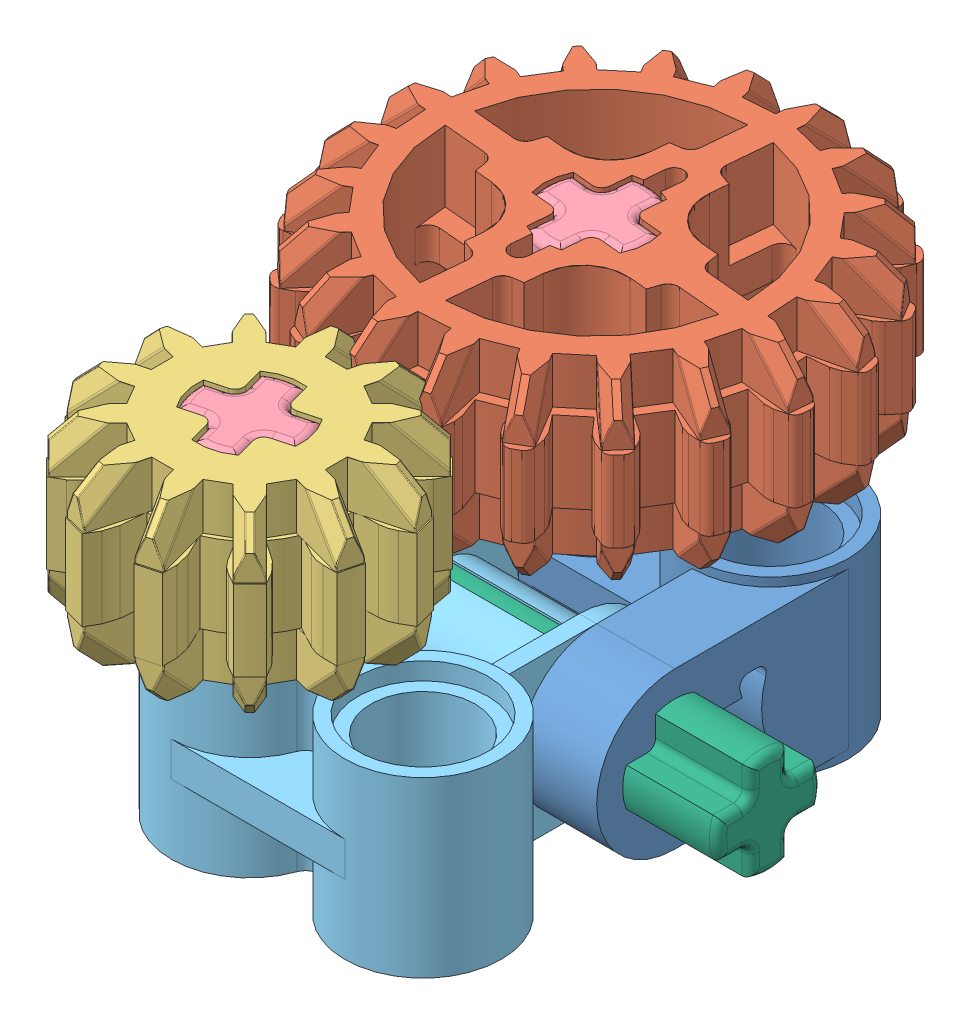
SolidWorks assembly Assem1.sldasm, configuration Default (file format 12000). Lengths in mm.
Overall size (27.57 16.06 35.71).
7 component instances, 6 part files, 20 mates.
Components (placement in the parent):
- 41678 Axle and Pin Connector Perpendicular Double Split Red-1: 41678 Axle and Pin Connector Perpendicular Double Split Red.SLDPRT [Default] at (7.7272 8.7333 3.9287) size (15.2 8 15.2)
- 32269 Gear 20 Tooth Double Bevel Gray-1: 32269 Gear 20 Tooth Double Bevel Gray.SLDPRT [Default] at (7.7272 16.7333 3.9287) x (0.995952 0 0.089887) z (-0.089887 0 0.995952) size (21.33 8.11 21.33)
- 32270 Gear 12 Tooth Double Bevel-1: 32270 Gear 12 Tooth Double Bevel.SLDPRT [Default] at (7.7272 16.7333 19.9287) x (0.261031 0 0.96533) z (-0.96533 0 0.261031) size (13.27 8.11 13.27)
- 3749 Axle Pin without Friction Ridges Lengthwise-1: 3749 Axle Pin without Friction Ridges Lengthwise.SLDPRT [Default] at (7.7272 12.7333 19.9287) x (0.96533 0 -0.261031) z (0.261031 0 0.96533) size (6 16 6)
- 3749 Axle Pin without Friction Ridges Lengthwise-2: 3749 Axle Pin without Friction Ridges Lengthwise.SLDPRT [Default] at (7.7272 12.7333 3.9287) x (0.995952 0 0.089887) z (-0.089887 0 0.995952) size (6 16 6)
- 32291 Axle and Pin Connector Perpendicular Double Green-2: 32291 Axle and Pin Connector Perpendicular Double Green.SLDPRT [Default] at (15.7272 8.7333 19.9287) x (-1 0 0) z (0 0 -1) size (15.2 8 15.2)
- 4519 Axle 3-1: 4519 Axle 3.SLDPRT [Default] at (-0.2878 8.7333 11.9287) x (0 -1 0) z (0 0 1) size (4.8 24 4.8)
Mates (geometry in assembly coordinates):
- Concentric11: concentric aligned: cylinder of 41678 Axle and Pin Connector Perpendicular Double Split Red-1 through (7.7272 4.7333 3.9287) axis (0 1 0) radius 2.4; cylinder of 3749 Axle Pin without Friction Ridges Lengthwise-2 through (7.7272 4.7333 3.9287) axis (0 1 0) radius 2.4
- Coincident11: coincident anti-aligned: plane of 41678 Axle and Pin Connector Perpendicular Double Split Red-1 through (7.7272 11.9333 3.9287) normal (0 1 0); plane of 3749 Axle Pin without Friction Ridges Lengthwise-2 through (7.7272 11.9333 3.9287) normal (0 -1 0)
- Coincident12: coincident anti-aligned: plane of 41678 Axle and Pin Connector Perpendicular Double Split Red-1 through (15.7272 8.7333 11.9287) normal (-1 0 0); plane of 32291 Axle and Pin Connector Perpendicular Double Green-2 through (15.7272 5.1333 0.3287) normal (1 0 0)
- Concentric12: concentric anti-aligned: cylinder of 41678 Axle and Pin Connector Perpendicular Double Split Red-1 through (15.7272 8.7333 11.9287) axis (1 0 0) radius 2.4; cylinder of 32291 Axle and Pin Connector Perpendicular Double Green-2 through (19.3272 8.7333 11.9287) axis (-1 0 0) radius 2.4
- Concentric13: concentric anti-aligned: cylinder of 41678 Axle and Pin Connector Perpendicular Double Split Red-1 through (15.7272 8.7333 11.9287) axis (1 0 0) radius 2.4; cylinder of 32291 Axle and Pin Connector Perpendicular Double Green-2 through (19.3272 8.7333 11.9287) axis (-1 0 0) radius 2.4
- Coincident13: coincident aligned: plane of 41678 Axle and Pin Connector Perpendicular Double Split Red-1 through (15.7272 10.0133 11.0487) normal (0 0 1); plane of 32291 Axle and Pin Connector Perpendicular Double Green-2 through (19.3272 10.9662 11.0487) normal (0 0 1)
- Concentric14: concentric aligned: cylinder of 3749 Axle Pin without Friction Ridges Lengthwise-1 through (7.7272 4.7333 19.9287) axis (0 1 0) radius 2.4; cylinder of 32291 Axle and Pin Connector Perpendicular Double Green-2 through (7.7272 4.7333 19.9287) axis (0 1 0) radius 2.4
- Coincident14: coincident anti-aligned: plane of 3749 Axle Pin without Friction Ridges Lengthwise-1 through (7.7272 11.9333 19.9287) normal (0 -1 0); plane of 32291 Axle and Pin Connector Perpendicular Double Green-2 through (7.7272 11.9333 19.9287) normal (0 1 0)
- Concentric15: concentric anti-aligned: cylinder of 32270 Gear 12 Tooth Double Bevel-1 through (7.7272 12.6758 19.9287) axis (0 1 0) radius 2.4; cylinder of 3749 Axle Pin without Friction Ridges Lengthwise-1 through (7.7272 20.7333 19.9287) axis (0 -1 0) radius 2.4
- Coincident15: coincident anti-aligned: plane of 32270 Gear 12 Tooth Double Bevel-1 through (10.1124 12.6758 20.1954) normal (-0.261031 0 -0.96533); plane of 3749 Axle Pin without Friction Ridges Lengthwise-1 through (9.1925 20.7333 20.4441) normal (0.261031 0 0.96533)
- Coincident16: coincident anti-aligned: plane of 32270 Gear 12 Tooth Double Bevel-1 through (7.7272 12.7333 19.9287) normal (0 -1 0); plane of 32291 Axle and Pin Connector Perpendicular Double Green-2 through (15.7272 12.7333 19.9287) normal (0 1 0)
- Concentric16: concentric anti-aligned: cylinder of 32269 Gear 20 Tooth Double Bevel Gray-1 through (7.7272 12.6783 3.9287) axis (0 1 0) radius 2.4; cylinder of 3749 Axle Pin without Friction Ridges Lengthwise-2 through (7.7272 20.7333 3.9287) axis (0 -1 0) radius 2.4
- Coincident17: coincident anti-aligned: plane of 32269 Gear 20 Tooth Double Bevel Gray-1 through (8.9229 12.6783 4.9202) normal (0.089887 0 -0.995952); plane of 3749 Axle Pin without Friction Ridges Lengthwise-2 through (8.9229 20.7333 4.9202) normal (-0.089887 0 0.995952)
- Coincident18: coincident anti-aligned: plane of 41678 Axle and Pin Connector Perpendicular Double Split Red-1 through (7.7272 12.7333 3.9287) normal (0 1 0); plane of 32269 Gear 20 Tooth Double Bevel Gray-1 through (7.7272 12.7333 3.9287) normal (0 -1 0)
- Concentric17: concentric anti-aligned: cylinder of 41678 Axle and Pin Connector Perpendicular Double Split Red-1 through (15.7272 8.7333 11.9287) axis (1 0 0) radius 2.4; cylinder of 4519 Axle 3-1 through (23.7122 8.7333 11.9287) axis (-1 0 0) radius 2.4
- Concentric18: concentric anti-aligned: cylinder of 41678 Axle and Pin Connector Perpendicular Double Split Red-1 through (15.7272 8.7333 11.9287) axis (1 0 0) radius 2.4; cylinder of 4519 Axle 3-1 through (23.7122 8.7333 11.9287) axis (-1 0 0) radius 2.4
- Concentric19: concentric aligned: cylinder of 32291 Axle and Pin Connector Perpendicular Double Green-2 through (19.3272 8.7333 11.9287) axis (-1 0 0) radius 2.4; cylinder of 4519 Axle 3-1 through (23.7122 8.7333 11.9287) axis (-1 0 0) radius 2.4
- Coincident19: coincident anti-aligned: plane of 41678 Axle and Pin Connector Perpendicular Double Split Red-1 through (15.7272 10.9662 12.8087) normal (0 0 -1); plane of 4519 Axle 3-1 through (23.7122 9.6133 12.8087) normal (0 0 1)
- Distance2: distance = 4.385 mm aligned: plane of 4519 Axle 3-1 through (23.7122 8.7333 11.9287) normal (1 0 0); plane of 41678 Axle and Pin Connector Perpendicular Double Split Red-1 through (19.3272 4.7333 7.5287) normal (1 0 0)
- GearMate2: gear = 13.97 mm: circle of 32270 Gear 12 Tooth Double Bevel-1; circle of 32269 Gear 20 Tooth Double Bevel Gray-1
